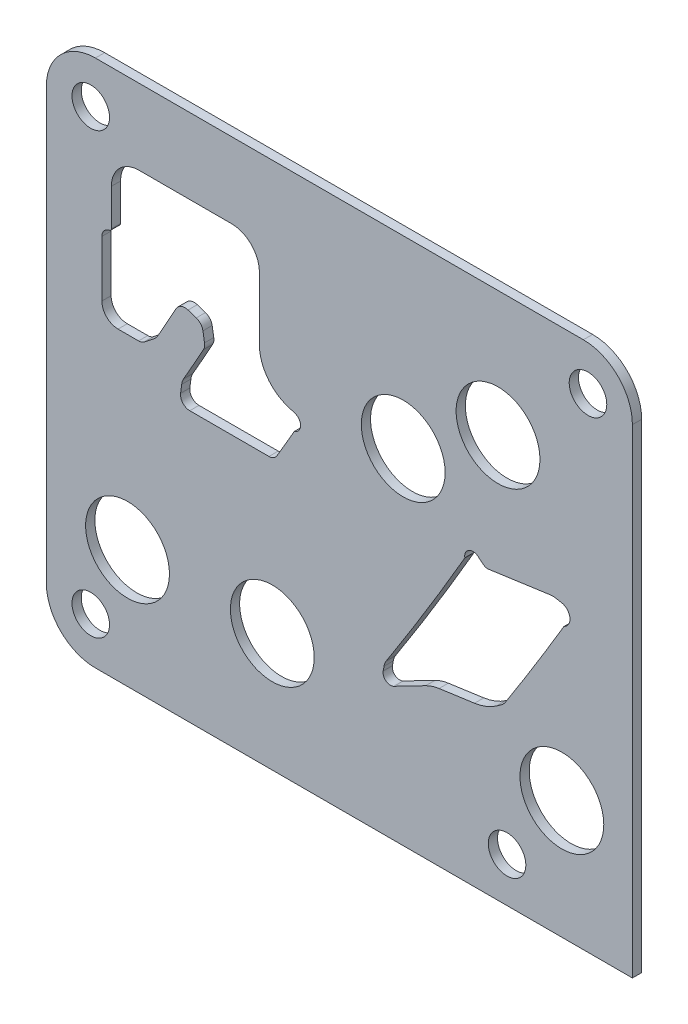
from build123d import *

# Parameters (mm, degrees)
BOSS_EXTRUDE1_DEPTH                            = 2.54
HOLE1_D                                        = 23.01875
HOLE11_D                                       = 10.3124
CUT_EXTRUDE1_QU250515L_PUNCH1_MOUNTED_IN_DEPTH = 1035.749194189
CUT_EXTRUDE1_QU250515L_PUNCH4_MOUNTED_IN_DEPTH = 1035.749194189
CUT_EXTRUDE1_DEPTH                             = 1035.749194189


with BuildPart() as part:
    # Sketch2 → Boss-Extrude1 (new body)
    with BuildSketch(Plane.XY.offset(-29.21)):
        with BuildLine():
            Line((-1013.5235, -18.542), (-866.0765, -18.542))
            Line((-866.0765, -18.542), (-866.0765, 113.03))
            ThreePointArc((-866.0765, 113.03), (-870.019428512, 122.549071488), (-879.5385, 126.492))
            Line((-879.5385, 126.492), (-1013.5235, 126.492))
            ThreePointArc((-1013.5235, 126.492), (-1023.042571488, 122.549071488), (-1026.9855, 113.03))
            Line((-1026.9855, 113.03), (-1026.9855, -5.08))
            ThreePointArc((-1026.9855, -5.08), (-1023.042571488, -14.599071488), (-1013.5235, -18.542))
        make_face()
    extrude(amount=-BOSS_EXTRUDE1_DEPTH)

    # Hole1 (through all)
    with Locations(Plane(origin=(-1008.351260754, 24.571140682, -29.21), x_dir=(1, 0, 0), z_dir=(0, 0, 1))):
        with Locations((3.654260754, -10.601140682), (43.405260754, -10.601140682), (122.907260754, -10.601140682), (79.346260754, 51.324059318), (105.381260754, 67.503859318)):
            Hole(HOLE1_D / 2)

    # Hole11 (through all)
    with Locations(Plane(origin=(-904.147760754, 10.601140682, -29.21), x_dir=(1, 0, 0), z_dir=(0, 0, 1))):
        with Locations((3.654260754, -16.951140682), (25.879260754, 103.698859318), (-110.645739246, 103.698859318), (-110.645739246, -16.951140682)):
            Hole(HOLE11_D / 2)

    # Sketch1 QU250515L_Punch1_Mounted in the → Cut-Extrude1 QU250515L_Punch1_Mounted in (cut, through all)
    with BuildSketch(Plane.XY.offset(-29.21)):
        with BuildLine():
            Line((-934.269956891, 21.504441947), (-934.50223765, 20.246169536))
            ThreePointArc((-934.50223765, 20.246169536), (-933.714566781, 18.245249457), (-931.57117917, 18.072055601))
            Line((-931.57117917, 18.072055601), (-922.82111704, 22.593490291))
            ThreePointArc((-922.82111704, 22.593490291), (-921.042141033, 23.330188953), (-919.164744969, 23.75781562))
            Line((-919.164744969, 23.75781562), (-909.411385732, 25.128560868))
            ThreePointArc((-909.411385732, 25.128560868), (-906.252652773, 25.957972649), (-903.372797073, 27.49808594))
            Line((-903.372797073, 27.49808594), (-902.12212218, 28.368940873))
            ThreePointArc((-902.12212218, 28.368940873), (-901.479731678, 28.916824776), (-900.956235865, 29.579240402))
            ThreePointArc((-900.956235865, 29.579240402), (-892.807920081, 42.522916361), (-884.89448587, 55.611512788))
            ThreePointArc((-884.89448587, 55.611512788), (-884.847905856, 55.669002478), (-884.786733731, 55.710628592))
            ThreePointArc((-884.786733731, 55.710628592), (-883.238084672, 58.610311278), (-885.520196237, 60.97641364))
            Line((-885.520196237, 60.97641364), (-887.204889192, 61.273470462))
            ThreePointArc((-887.204889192, 61.273470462), (-887.899179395, 61.340323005), (-888.595379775, 61.297741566))
            Line((-888.595379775, 61.297741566), (-905.551637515, 58.914694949))
            ThreePointArc((-905.551637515, 58.914694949), (-906.336776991, 58.968504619), (-907.033169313, 59.335079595))
            Line((-907.033169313, 59.335079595), (-908.401506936, 60.470392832))
            ThreePointArc((-908.401506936, 60.470392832), (-910.951175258, 60.70897997), (-912.100701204, 58.42067875))
            ThreePointArc((-912.100701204, 58.42067875), (-912.103268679, 58.337473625), (-912.132598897, 58.259567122))
            ThreePointArc((-912.132598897, 58.259567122), (-922.680705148, 40.53074857), (-933.652451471, 23.060936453))
            ThreePointArc((-933.652451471, 23.060936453), (-934.037377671, 22.312909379), (-934.269956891, 21.504441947))
        make_face()
    extrude(amount=-CUT_EXTRUDE1_QU250515L_PUNCH1_MOUNTED_IN_DEPTH, mode=Mode.SUBTRACT)

    # Sketch1 QU250515L_Punch4_Mounted in the → Cut-Extrude1 QU250515L_Punch4_Mounted in (cut, through all)
    with BuildSketch(Plane.XY.offset(-29.21)):
        with BuildLine():
            Line((-987.611398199, 55.583461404), (-965.862080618, 55.583461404))
            ThreePointArc((-965.862080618, 55.583461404), (-964.602547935, 55.917746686), (-963.67454536, 56.832613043))
            ThreePointArc((-963.67454536, 56.832613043), (-961.286570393, 60.905264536), (-958.921316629, 64.991153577))
            ThreePointArc((-958.921316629, 64.991153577), (-958.859839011, 65.062832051), (-958.776426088, 65.107099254))
            ThreePointArc((-958.776426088, 65.107099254), (-957.17927158, 67.277902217), (-958.78180097, 69.444740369))
            Line((-958.78180097, 69.444740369), (-960.432867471, 69.952672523))
            ThreePointArc((-960.432867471, 69.952672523), (-966.266009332, 74.086581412), (-968.502, 80.877390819))
            Line((-968.502, 80.877390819), (-968.502, 98.171))
            ThreePointArc((-968.502, 98.171), (-970.733846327, 103.559153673), (-976.122, 105.791))
            Line((-976.122, 105.791), (-1001.522, 105.791))
            ThreePointArc((-1001.522, 105.791), (-1006.910153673, 103.559153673), (-1009.142, 98.171))
            Line((-1009.142, 98.171), (-1009.142, 69.596))
            ThreePointArc((-1009.142, 69.596), (-1007.840089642, 66.452910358), (-1004.697, 65.151))
            Line((-1004.697, 65.151), (-1001.662584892, 65.151))
            ThreePointArc((-1001.662584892, 65.151), (-1000.836383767, 65.289127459), (-1000.100041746, 65.68848685))
            Line((-1000.100041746, 65.68848685), (-997.474178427, 67.737424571))
            ThreePointArc((-997.474178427, 67.737424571), (-996.862507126, 68.319404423), (-996.375778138, 69.009286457))
            ThreePointArc((-996.375778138, 69.009286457), (-993.840912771, 73.50445997), (-991.333462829, 78.014983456))
            ThreePointArc((-991.333462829, 78.014983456), (-989.93815861, 79.238092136), (-988.083300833, 79.286788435))
            Line((-988.083300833, 79.286788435), (-985.827056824, 78.537856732))
            ThreePointArc((-985.827056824, 78.537856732), (-984.610837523, 77.719443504), (-983.993294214, 76.389921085))
            Line((-983.993294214, 76.389921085), (-983.557706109, 73.741498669))
            ThreePointArc((-983.557706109, 73.741498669), (-983.561627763, 72.832174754), (-983.863987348, 71.974582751))
            ThreePointArc((-983.863987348, 71.974582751), (-986.567203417, 67.13640596), (-989.301648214, 62.315810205))
            ThreePointArc((-989.301648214, 62.315810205), (-989.64594648, 61.548235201), (-989.834878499, 60.728468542))
            Line((-989.834878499, 60.728468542), (-990.130310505, 58.450081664))
            ThreePointArc((-990.130310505, 58.450081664), (-989.519435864, 56.44686), (-987.611398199, 55.583461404))
        make_face()
    extrude(amount=-CUT_EXTRUDE1_QU250515L_PUNCH4_MOUNTED_IN_DEPTH, mode=Mode.SUBTRACT)

    # Sketch3 → Cut-Extrude1 (cut, through all)
    with BuildSketch(Plane.XY.offset(-29.21)):
        with BuildLine():
            Line((-1011.74296, 84.963), (-1011.74296, 69.596))
            ThreePointArc((-1011.74296, 69.596), (-1010.441049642, 66.452910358), (-1007.29796, 65.151))
            Line((-1007.29796, 65.151), (-1004.697, 65.151))
            ThreePointArc((-1004.697, 65.151), (-1007.840089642, 66.452910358), (-1009.142, 69.596))
            Line((-1009.142, 69.596), (-1009.142, 88.085675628))
            ThreePointArc((-1009.142, 88.085675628), (-1009.289670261, 87.677650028), (-1009.664272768, 87.458642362))
            ThreePointArc((-1009.664272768, 87.458642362), (-1011.155220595, 86.5869744), (-1011.74296, 84.963))
        make_face()
    extrude(amount=-CUT_EXTRUDE1_DEPTH, mode=Mode.SUBTRACT)


solid = part.part
